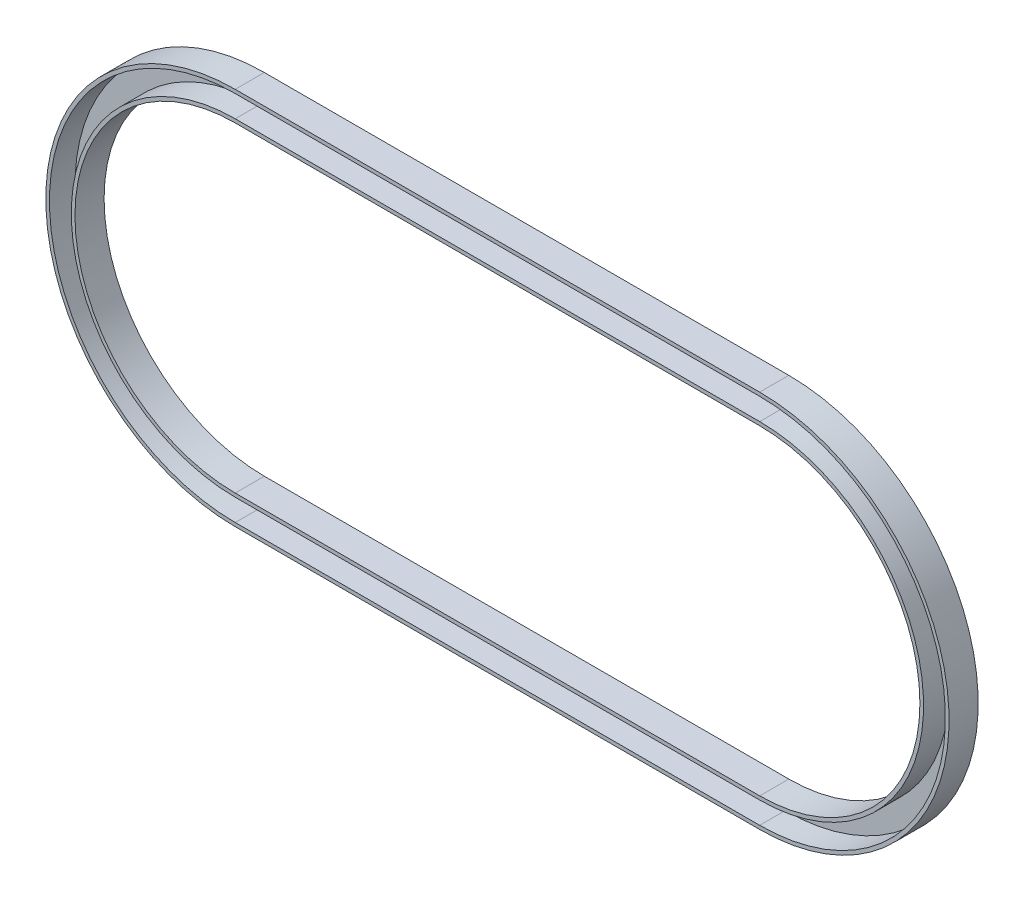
from build123d import *

# Parameters (mm, degrees)
BASE_EXTRUDE_DEPTH = 25.4
SHELL1_T           = -3.175


with BuildPart() as part:
    # Sketch1 → Base-Extrude (new body)
    with BuildSketch(Plane.XY):
        with BuildLine():
            Line((457.2, 165.1), (0, 165.1))
            ThreePointArc((0, 165.1), (-165.1, 0), (0, -165.1))
            Line((0, -165.1), (457.2, -165.1))
            ThreePointArc((457.2, -165.1), (622.3, 0), (457.2, 165.1))
        make_face()
        with BuildLine():
            Line((457.2, 139.7), (0, 139.7))
            ThreePointArc((0, 139.7), (-139.7, 0), (0, -139.7))
            Line((0, -139.7), (457.2, -139.7))
            ThreePointArc((457.2, -139.7), (596.9, 0), (457.2, 139.7))
        make_face(mode=Mode.SUBTRACT)
    extrude(amount=BASE_EXTRUDE_DEPTH)

    # Shell1
    shell1_openings = [part.faces().sort_by_distance(p)[0] for p in [
        (228.6, 156.561669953, 25.4),
    ]]
    offset(amount=SHELL1_T, openings=shell1_openings, kind=Kind.INTERSECTION)


solid = part.part
